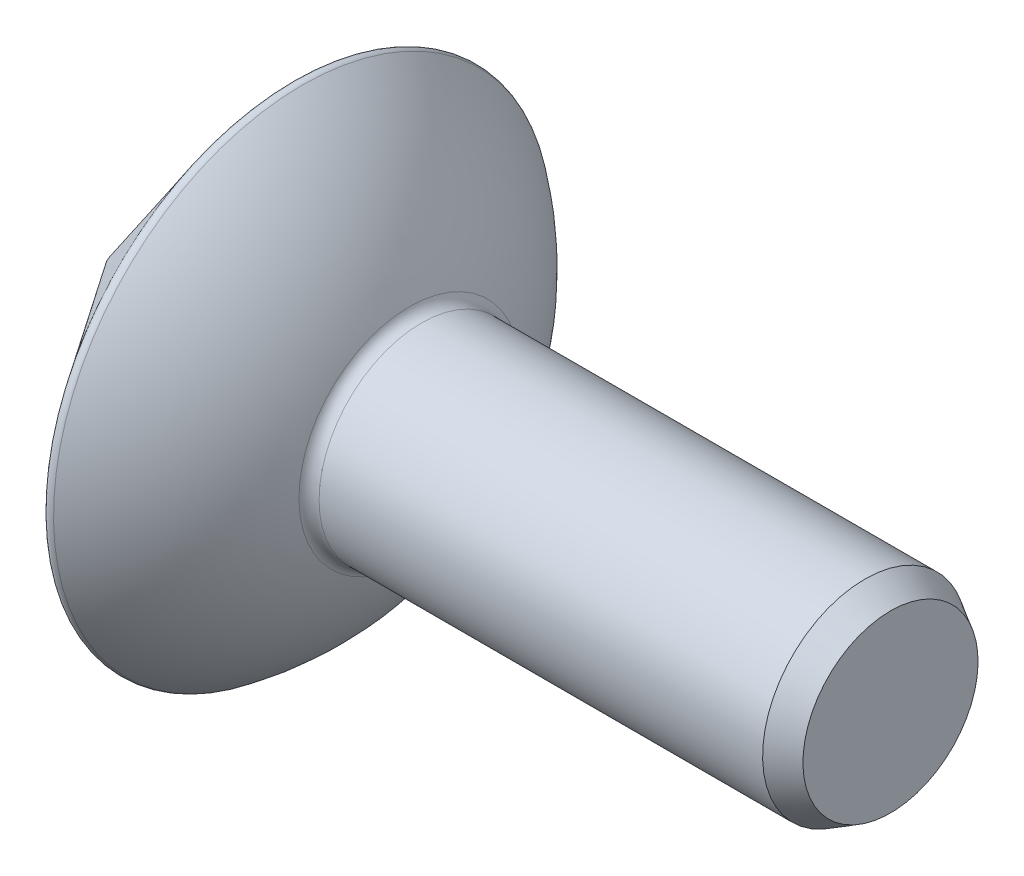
ISO-10303-21;
HEADER;
FILE_DESCRIPTION(('STEP AP214'),'2;1');
FILE_NAME('part.step','',(''),(''),'','','');
FILE_SCHEMA(('AUTOMOTIVE_DESIGN { 1 0 10303 214 1 1 1 1 }'));
ENDSEC;
DATA;
#1=APPLICATION_CONTEXT('core data for automotive mechanical design processes');
#2=APPLICATION_PROTOCOL_DEFINITION('international standard','automotive_design',2000,#1);
#3=PRODUCT_CONTEXT('',#1,'mechanical');
#4=PRODUCT('Part','Part','',(#3));
#5=PRODUCT_RELATED_PRODUCT_CATEGORY('part','',(#4));
#6=PRODUCT_DEFINITION_FORMATION('','',#4);
#7=PRODUCT_DEFINITION_CONTEXT('part definition',#1,'design');
#8=PRODUCT_DEFINITION('design','',#6,#7);
#9=PRODUCT_DEFINITION_SHAPE('','',#8);
#10=(LENGTH_UNIT() NAMED_UNIT(*) SI_UNIT(.MILLI.,.METRE.));
#11=(NAMED_UNIT(*) PLANE_ANGLE_UNIT() SI_UNIT($,.RADIAN.));
#12=(NAMED_UNIT(*) SI_UNIT($,.STERADIAN.) SOLID_ANGLE_UNIT());
#13=UNCERTAINTY_MEASURE_WITH_UNIT(LENGTH_MEASURE(1.E-05),#10,'distance_accuracy_value','');
#14=(GEOMETRIC_REPRESENTATION_CONTEXT(3) GLOBAL_UNCERTAINTY_ASSIGNED_CONTEXT((#13)) GLOBAL_UNIT_ASSIGNED_CONTEXT((#10,
#11,#12)) REPRESENTATION_CONTEXT('',''));
#15=CARTESIAN_POINT('',(0.,0.,0.));
#16=DIRECTION('',(0.,0.,1.));
#17=DIRECTION('',(1.,0.,0.));
#18=AXIS2_PLACEMENT_3D('',#15,#16,#17);
#19=CARTESIAN_POINT('',(30.,4.,0.));
#20=DIRECTION('',(1.,0.,0.));
#21=DIRECTION('',(0.,1.,0.));
#22=AXIS2_PLACEMENT_3D('',#19,#20,#21);
#23=PLANE('',#22);
#24=CARTESIAN_POINT('',(30.,0.,0.));
#25=DIRECTION('',(1.,0.,0.));
#26=DIRECTION('',(0.,1.,0.));
#27=AXIS2_PLACEMENT_3D('',#24,#25,#26);
#28=CIRCLE('',#27,3.42264973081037);
#29=CARTESIAN_POINT('',(30.,3.42264973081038,0.));
#30=VERTEX_POINT('',#29);
#31=EDGE_CURVE('E47',#30,#30,#28,.T.);
#32=ORIENTED_EDGE('',*,*,#31,.T.);
#33=EDGE_LOOP('',(#32));
#34=FACE_BOUND('',#33,.T.);
#35=ADVANCED_FACE('F32',(#34),#23,.T.);
#36=CARTESIAN_POINT('',(0.,0.,0.));
#37=DIRECTION('',(1.,0.,0.));
#38=DIRECTION('',(0.,1.,0.));
#39=AXIS2_PLACEMENT_3D('',#36,#37,#38);
#40=CYLINDRICAL_SURFACE('',#39,4.);
#41=CARTESIAN_POINT('',(11.6619037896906,0.,0.));
#42=DIRECTION('',(-1.,0.,0.));
#43=DIRECTION('',(0.,-1.,0.));
#44=AXIS2_PLACEMENT_3D('',#41,#42,#43);
#45=CIRCLE('',#44,4.);
#46=CARTESIAN_POINT('',(11.6619037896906,-3.99999999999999,0.));
#47=VERTEX_POINT('',#46);
#48=EDGE_CURVE('E39',#47,#47,#45,.F.);
#49=ORIENTED_EDGE('',*,*,#48,.T.);
#50=EDGE_LOOP('',(#49));
#51=FACE_BOUND('',#50,.T.);
#52=CARTESIAN_POINT('',(29.,0.,0.));
#53=DIRECTION('',(1.,0.,0.));
#54=DIRECTION('',(0.,1.,0.));
#55=AXIS2_PLACEMENT_3D('',#52,#53,#54);
#56=CIRCLE('',#55,4.);
#57=CARTESIAN_POINT('',(29.,4.,0.));
#58=VERTEX_POINT('',#57);
#59=EDGE_CURVE('E43',#58,#58,#56,.F.);
#60=ORIENTED_EDGE('',*,*,#59,.T.);
#61=EDGE_LOOP('',(#60));
#62=FACE_BOUND('',#61,.T.);
#63=ADVANCED_FACE('F79',(#51,#62),#40,.T.);
#64=CARTESIAN_POINT('',(0.,0.,0.));
#65=DIRECTION('',(1.,0.,0.));
#66=DIRECTION('',(0.,1.,0.));
#67=AXIS2_PLACEMENT_3D('',#64,#65,#66);
#68=SPHERICAL_SURFACE('',#67,12.);
#69=CARTESIAN_POINT('',(11.195427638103,0.,0.));
#70=DIRECTION('',(-1.,0.,0.));
#71=DIRECTION('',(0.,-1.,0.));
#72=AXIS2_PLACEMENT_3D('',#69,#70,#71);
#73=CIRCLE('',#72,4.32);
#74=CARTESIAN_POINT('',(11.195427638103,4.32,0.));
#75=VERTEX_POINT('',#74);
#76=EDGE_CURVE('E10',#75,#75,#73,.T.);
#77=CARTESIAN_POINT('',(7.01623852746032,0.,0.));
#78=DIRECTION('',(-1.,0.,0.));
#79=DIRECTION('',(0.,-1.,0.));
#80=AXIS2_PLACEMENT_3D('',#77,#78,#79);
#81=CIRCLE('',#80,9.73511155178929);
#82=CARTESIAN_POINT('',(7.01623852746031,9.73511155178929,0.));
#83=VERTEX_POINT('',#82);
#84=EDGE_CURVE('E55',#83,#83,#81,.F.);
#85=CARTESIAN_POINT('',(11.195427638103,4.32,0.));
#86=CARTESIAN_POINT('',(11.1694161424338,4.38740989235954,0.));
#87=CARTESIAN_POINT('',(11.1427956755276,4.45458479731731,0.));
#88=CARTESIAN_POINT('',(11.0883457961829,4.58844284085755,0.));
#89=CARTESIAN_POINT('',(11.0605163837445,4.65512597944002,0.));
#90=CARTESIAN_POINT('',(11.0036576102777,4.78797869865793,0.));
#91=CARTESIAN_POINT('',(10.9746282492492,4.85414827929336,0.));
#92=CARTESIAN_POINT('',(10.9153790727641,4.98595230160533,0.));
#93=CARTESIAN_POINT('',(10.8851592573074,5.05158674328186,0.));
#94=CARTESIAN_POINT('',(10.8235390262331,5.18229906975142,0.));
#95=CARTESIAN_POINT('',(10.7921386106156,5.24737695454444,0.));
#96=CARTESIAN_POINT('',(10.7281674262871,5.37695493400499,0.));
#97=CARTESIAN_POINT('',(10.6955966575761,5.44145502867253,0.));
#98=CARTESIAN_POINT('',(10.6292953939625,5.56985638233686,0.));
#99=CARTESIAN_POINT('',(10.5955648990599,5.63375764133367,0.));
#100=CARTESIAN_POINT('',(10.5269551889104,5.76094047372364,0.));
#101=CARTESIAN_POINT('',(10.4920759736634,5.82422204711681,0.));
#102=CARTESIAN_POINT('',(10.4211802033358,5.95014486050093,0.));
#103=CARTESIAN_POINT('',(10.3851636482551,6.01278610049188,0.));
#104=CARTESIAN_POINT('',(10.312004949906,6.13740780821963,0.));
#105=CARTESIAN_POINT('',(10.2748628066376,6.19938827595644,0.));
#106=CARTESIAN_POINT('',(10.1994650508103,6.32266821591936,0.));
#107=CARTESIAN_POINT('',(10.1612094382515,6.38396768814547,0.));
#108=CARTESIAN_POINT('',(10.0835972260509,6.50586563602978,0.));
#109=CARTESIAN_POINT('',(10.0442406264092,6.56646411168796,0.));
#110=CARTESIAN_POINT('',(9.96443928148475,6.68694029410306,0.));
#111=CARTESIAN_POINT('',(9.923994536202,6.74681800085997,0.));
#112=CARTESIAN_POINT('',(9.84203009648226,6.86583310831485,0.));
#113=CARTESIAN_POINT('',(9.80051040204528,6.92497050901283,0.));
#114=CARTESIAN_POINT('',(9.71640961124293,7.04248570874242,0.));
#115=CARTESIAN_POINT('',(9.67382851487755,7.10086350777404,0.));
#116=CARTESIAN_POINT('',(9.5876188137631,7.21684045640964,0.));
#117=CARTESIAN_POINT('',(9.54399020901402,7.27443960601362,0.));
#118=CARTESIAN_POINT('',(9.45569972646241,7.38884046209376,0.));
#119=CARTESIAN_POINT('',(9.41103784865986,7.44564216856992,0.));
#120=CARTESIAN_POINT('',(9.32069539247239,7.55842960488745,0.));
#121=CARTESIAN_POINT('',(9.27501481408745,7.61441533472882,0.));
#122=CARTESIAN_POINT('',(9.18264986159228,7.72555255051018,0.));
#123=CARTESIAN_POINT('',(9.13596548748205,7.78070403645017,0.));
#124=CARTESIAN_POINT('',(9.04160817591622,7.8901547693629,0.));
#125=CARTESIAN_POINT('',(8.99393523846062,7.94445401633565,0.));
#126=CARTESIAN_POINT('',(8.89761635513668,8.05218255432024,0.));
#127=CARTESIAN_POINT('',(8.84897040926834,8.10561184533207,0.));
#128=CARTESIAN_POINT('',(8.75072138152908,8.21158303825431,0.));
#129=CARTESIAN_POINT('',(8.70111829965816,8.26412494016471,0.));
#130=CARTESIAN_POINT('',(8.60097118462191,8.36830421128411,0.));
#131=CARTESIAN_POINT('',(8.55042715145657,8.41994158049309,0.));
#132=CARTESIAN_POINT('',(8.44841462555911,8.52229493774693,0.));
#133=CARTESIAN_POINT('',(8.39694613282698,8.57301092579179,0.));
#134=CARTESIAN_POINT('',(8.2931014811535,8.67350497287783,0.));
#135=CARTESIAN_POINT('',(8.24072532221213,8.72328303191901,0.));
#136=CARTESIAN_POINT('',(8.13508242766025,8.82188497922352,0.));
#137=CARTESIAN_POINT('',(8.08181569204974,8.87070886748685,0.));
#138=CARTESIAN_POINT('',(7.97440902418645,8.96738654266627,0.));
#139=CARTESIAN_POINT('',(7.92026909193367,9.01524032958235,0.));
#140=CARTESIAN_POINT('',(7.81113369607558,9.10996218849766,0.));
#141=CARTESIAN_POINT('',(7.75613823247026,9.15683026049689,0.));
#142=CARTESIAN_POINT('',(7.64530971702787,9.24956539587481,0.));
#143=CARTESIAN_POINT('',(7.5894766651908,9.29543245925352,0.));
#144=CARTESIAN_POINT('',(7.47699119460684,9.38615061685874,0.));
#145=CARTESIAN_POINT('',(7.42033877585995,9.43100171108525,0.));
#146=CARTESIAN_POINT('',(7.30623304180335,9.51967327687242,0.));
#147=CARTESIAN_POINT('',(7.24877972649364,9.56349374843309,0.));
#148=CARTESIAN_POINT('',(7.13309099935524,9.65008984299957,0.));
#149=CARTESIAN_POINT('',(7.07485558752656,9.69286546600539,0.));
#150=CARTESIAN_POINT('',(7.01623852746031,9.73511155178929,0.));
#151=B_SPLINE_CURVE_WITH_KNOTS('',3,(#85,#86,#87,#88,#89,#90,#91,#92,#93,#94,#95,#96,#97,#98,
#99,#100,#101,#102,#103,#104,#105,#106,#107,#108,#109,#110,#111,#112,#113,#114,#115,#116,#117,
#118,#119,#120,#121,#122,#123,#124,#125,#126,#127,#128,#129,#130,#131,#132,#133,#134,#135,#136,
#137,#138,#139,#140,#141,#142,#143,#144,#145,#146,#147,#148,#149,#150),.UNSPECIFIED.,.F.,.F.,(4,
2,2,2,2,2,2,2,2,2,2,2,2,2,2,2,2,2,2,2,2,2,2,2,2,2,2,2,2,2,2,2,4),(0.,0.216760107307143,
0.433520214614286,0.650280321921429,0.867040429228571,1.08380053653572,1.30056064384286,
1.51732075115,1.73408085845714,1.95084096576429,2.16760107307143,2.38436118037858,
2.60112128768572,2.81788139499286,3.0346415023,3.25140160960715,3.46816171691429,
3.68492182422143,3.90168193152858,4.11844203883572,4.33520214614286,4.55196225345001,
4.76872236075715,4.98548246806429,5.20224257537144,5.41900268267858,5.63576278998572,
5.85252289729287,6.06928300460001,6.28604311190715,6.50280321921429,6.71956332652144,
6.93632343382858),.UNSPECIFIED.);
#152=EDGE_CURVE('BSEAM75',#75,#83,#151,.T.);
#153=ORIENTED_EDGE('',*,*,#76,.T.);
#154=ORIENTED_EDGE('',*,*,#84,.T.);
#155=ORIENTED_EDGE('',*,*,#152,.T.);
#156=ORIENTED_EDGE('',*,*,#152,.F.);
#157=EDGE_LOOP('',(#153,#155,#154,#156));
#158=FACE_BOUND('',#157,.T.);
#159=ADVANCED_FACE('F75',(#158),#68,.T.);
#160=CARTESIAN_POINT('',(6.81619089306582,0.,0.));
#161=DIRECTION('',(1.,0.,0.));
#162=DIRECTION('',(0.,1.,0.));
#163=AXIS2_PLACEMENT_3D('',#160,#161,#162);
#164=CONICAL_SURFACE('',#163,9.87621089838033,0.92502450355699);
#165=CARTESIAN_POINT('',(6.67040801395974,0.,0.));
#166=DIRECTION('',(-1.,0.,0.));
#167=DIRECTION('',(0.,-1.,0.));
#168=AXIS2_PLACEMENT_3D('',#165,#166,#167);
#169=CIRCLE('',#168,9.6827504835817);
#170=CARTESIAN_POINT('',(6.67040801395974,9.6827504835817,0.));
#171=VERTEX_POINT('',#170);
#172=EDGE_CURVE('E52',#171,#171,#169,.T.);
#173=CARTESIAN_POINT('',(-0.399317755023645,0.,0.));
#174=DIRECTION('',(1.,0.,0.));
#175=DIRECTION('',(0.,1.,0.));
#176=AXIS2_PLACEMENT_3D('',#173,#174,#175);
#177=CIRCLE('',#176,0.300907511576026);
#178=CARTESIAN_POINT('',(-0.399317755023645,0.300907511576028,0.));
#179=VERTEX_POINT('',#178);
#180=EDGE_CURVE('E58',#179,#179,#177,.T.);
#181=CARTESIAN_POINT('',(6.67040801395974,9.6827504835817,0.));
#182=CARTESIAN_POINT('',(6.59676503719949,9.58502295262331,0.));
#183=CARTESIAN_POINT('',(6.52312206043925,9.48729542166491,0.));
#184=CARTESIAN_POINT('',(6.37583610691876,9.29184035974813,0.));
#185=CARTESIAN_POINT('',(6.30219313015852,9.19411282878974,0.));
#186=CARTESIAN_POINT('',(6.15490717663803,8.99865776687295,0.));
#187=CARTESIAN_POINT('',(6.08126419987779,8.90093023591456,0.));
#188=CARTESIAN_POINT('',(5.9339782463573,8.70547517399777,0.));
#189=CARTESIAN_POINT('',(5.86033526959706,8.60774764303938,0.));
#190=CARTESIAN_POINT('',(5.71304931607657,8.4122925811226,0.));
#191=CARTESIAN_POINT('',(5.63940633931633,8.3145650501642,0.));
#192=CARTESIAN_POINT('',(5.49212038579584,8.11910998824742,0.));
#193=CARTESIAN_POINT('',(5.41847740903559,8.02138245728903,0.));
#194=CARTESIAN_POINT('',(5.27119145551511,7.82592739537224,0.));
#195=CARTESIAN_POINT('',(5.19754847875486,7.72819986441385,0.));
#196=CARTESIAN_POINT('',(5.05026252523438,7.53274480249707,0.));
#197=CARTESIAN_POINT('',(4.97661954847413,7.43501727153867,0.));
#198=CARTESIAN_POINT('',(4.82933359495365,7.23956220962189,0.));
#199=CARTESIAN_POINT('',(4.7556906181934,7.1418346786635,0.));
#200=CARTESIAN_POINT('',(4.60840466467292,6.94637961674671,0.));
#201=CARTESIAN_POINT('',(4.53476168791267,6.84865208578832,0.));
#202=CARTESIAN_POINT('',(4.38747573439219,6.65319702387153,0.));
#203=CARTESIAN_POINT('',(4.31383275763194,6.55546949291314,0.));
#204=CARTESIAN_POINT('',(4.16654680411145,6.36001443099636,0.));
#205=CARTESIAN_POINT('',(4.09290382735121,6.26228690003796,0.));
#206=CARTESIAN_POINT('',(3.94561787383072,6.06683183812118,0.));
#207=CARTESIAN_POINT('',(3.87197489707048,5.96910430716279,0.));
#208=CARTESIAN_POINT('',(3.72468894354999,5.773649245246,0.));
#209=CARTESIAN_POINT('',(3.65104596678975,5.67592171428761,0.));
#210=CARTESIAN_POINT('',(3.50376001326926,5.48046665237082,0.));
#211=CARTESIAN_POINT('',(3.43011703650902,5.38273912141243,0.));
#212=CARTESIAN_POINT('',(3.28283108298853,5.18728405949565,0.));
#213=CARTESIAN_POINT('',(3.20918810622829,5.08955652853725,0.));
#214=CARTESIAN_POINT('',(3.0619021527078,4.89410146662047,0.));
#215=CARTESIAN_POINT('',(2.98825917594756,4.79637393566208,0.));
#216=CARTESIAN_POINT('',(2.84097322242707,4.60091887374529,0.));
#217=CARTESIAN_POINT('',(2.76733024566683,4.5031913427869,0.));
#218=CARTESIAN_POINT('',(2.62004429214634,4.30773628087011,0.));
#219=CARTESIAN_POINT('',(2.5464013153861,4.21000874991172,0.));
#220=CARTESIAN_POINT('',(2.39911536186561,4.01455368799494,0.));
#221=CARTESIAN_POINT('',(2.32547238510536,3.91682615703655,0.));
#222=CARTESIAN_POINT('',(2.17818643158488,3.72137109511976,0.));
#223=CARTESIAN_POINT('',(2.10454345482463,3.62364356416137,0.));
#224=CARTESIAN_POINT('',(1.95725750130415,3.42818850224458,0.));
#225=CARTESIAN_POINT('',(1.88361452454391,3.33046097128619,0.));
#226=CARTESIAN_POINT('',(1.73632857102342,3.13500590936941,0.));
#227=CARTESIAN_POINT('',(1.66268559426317,3.03727837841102,0.));
#228=CARTESIAN_POINT('',(1.51539964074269,2.84182331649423,0.));
#229=CARTESIAN_POINT('',(1.44175666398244,2.74409578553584,0.));
#230=CARTESIAN_POINT('',(1.29447071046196,2.54864072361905,0.));
#231=CARTESIAN_POINT('',(1.22082773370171,2.45091319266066,0.));
#232=CARTESIAN_POINT('',(1.07354178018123,2.25545813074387,0.));
#233=CARTESIAN_POINT('',(0.999898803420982,2.15773059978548,0.));
#234=CARTESIAN_POINT('',(0.852612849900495,1.9622755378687,0.));
#235=CARTESIAN_POINT('',(0.778969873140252,1.86454800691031,0.));
#236=CARTESIAN_POINT('',(0.631683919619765,1.66909294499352,0.));
#237=CARTESIAN_POINT('',(0.558040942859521,1.57136541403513,0.));
#238=CARTESIAN_POINT('',(0.410754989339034,1.37591035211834,0.));
#239=CARTESIAN_POINT('',(0.337112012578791,1.27818282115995,0.));
#240=CARTESIAN_POINT('',(0.189826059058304,1.08272775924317,0.));
#241=CARTESIAN_POINT('',(0.11618308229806,0.985000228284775,0.));
#242=CARTESIAN_POINT('',(-0.0311028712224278,0.789545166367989,0.));
#243=CARTESIAN_POINT('',(-0.104745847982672,0.691817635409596,0.));
#244=CARTESIAN_POINT('',(-0.252031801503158,0.496362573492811,0.));
#245=CARTESIAN_POINT('',(-0.325674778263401,0.398635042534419,0.));
#246=CARTESIAN_POINT('',(-0.399317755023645,0.300907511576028,0.));
#247=B_SPLINE_CURVE_WITH_KNOTS('',3,(#181,#182,#183,#184,#185,#186,#187,#188,#189,#190,#191,
#192,#193,#194,#195,#196,#197,#198,#199,#200,#201,#202,#203,#204,#205,#206,#207,#208,#209,#210,
#211,#212,#213,#214,#215,#216,#217,#218,#219,#220,#221,#222,#223,#224,#225,#226,#227,#228,#229,
#230,#231,#232,#233,#234,#235,#236,#237,#238,#239,#240,#241,#242,#243,#244,#245,#246),
.UNSPECIFIED.,.F.,.F.,(4,2,2,2,2,2,2,2,2,2,2,2,2,2,2,2,2,2,2,2,2,2,2,2,2,2,2,2,2,2,2,2,4),(0.,
0.367104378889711,0.734208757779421,1.10131313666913,1.46841751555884,1.83552189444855,
2.20262627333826,2.56973065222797,2.93683503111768,3.30393941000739,3.6710437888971,
4.03814816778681,4.40525254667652,4.77235692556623,5.13946130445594,5.50656568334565,
5.87367006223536,6.24077444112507,6.60787882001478,6.97498319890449,7.3420875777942,
7.70919195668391,8.07629633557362,8.44340071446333,8.81050509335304,9.17760947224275,
9.54471385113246,9.91181823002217,10.2789226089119,10.6460269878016,11.0131313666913,
11.380235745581,11.7473401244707),.UNSPECIFIED.);
#248=EDGE_CURVE('BSEAM62',#171,#179,#247,.T.);
#249=ORIENTED_EDGE('',*,*,#172,.T.);
#250=ORIENTED_EDGE('',*,*,#180,.T.);
#251=ORIENTED_EDGE('',*,*,#248,.T.);
#252=ORIENTED_EDGE('',*,*,#248,.F.);
#253=EDGE_LOOP('',(#249,#251,#250,#252));
#254=FACE_BOUND('',#253,.T.);
#255=ADVANCED_FACE('F62',(#254),#164,.T.);
#256=CARTESIAN_POINT('',(0.,0.,0.));
#257=DIRECTION('',(1.,0.,0.));
#258=DIRECTION('',(0.,1.,0.));
#259=AXIS2_PLACEMENT_3D('',#256,#257,#258);
#260=SPHERICAL_SURFACE('',#259,0.5);
#261=ORIENTED_EDGE('',*,*,#180,.F.);
#262=EDGE_LOOP('',(#261));
#263=FACE_BOUND('',#262,.T.);
#264=ADVANCED_FACE('F64',(#263),#260,.T.);
#265=CARTESIAN_POINT('',(6.87006689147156,0.,0.));
#266=DIRECTION('',(-1.,0.,0.));
#267=DIRECTION('',(0.,-1.,0.));
#268=AXIS2_PLACEMENT_3D('',#265,#266,#267);
#269=TOROIDAL_SURFACE('',#268,9.53229672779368,0.25);
#270=ORIENTED_EDGE('',*,*,#172,.F.);
#271=EDGE_LOOP('',(#270));
#272=FACE_BOUND('',#271,.T.);
#273=ORIENTED_EDGE('',*,*,#84,.F.);
#274=EDGE_LOOP('',(#273));
#275=FACE_BOUND('',#274,.T.);
#276=ADVANCED_FACE('F66',(#272,#275),#269,.T.);
#277=CARTESIAN_POINT('',(30.,0.,0.));
#278=DIRECTION('',(-1.,0.,0.));
#279=DIRECTION('',(0.,-1.,0.));
#280=AXIS2_PLACEMENT_3D('',#277,#278,#279);
#281=CONICAL_SURFACE('',#280,3.42264973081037,0.523598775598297);
#282=ORIENTED_EDGE('',*,*,#59,.F.);
#283=EDGE_LOOP('',(#282));
#284=FACE_BOUND('',#283,.T.);
#285=ORIENTED_EDGE('',*,*,#31,.F.);
#286=EDGE_LOOP('',(#285));
#287=FACE_BOUND('',#286,.T.);
#288=ADVANCED_FACE('F72',(#284,#287),#281,.T.);
#289=CARTESIAN_POINT('',(11.6619037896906,0.,0.));
#290=DIRECTION('',(-1.,0.,0.));
#291=DIRECTION('',(0.,-1.,0.));
#292=AXIS2_PLACEMENT_3D('',#289,#290,#291);
#293=TOROIDAL_SURFACE('',#292,4.5,0.5);
#294=ORIENTED_EDGE('',*,*,#76,.F.);
#295=EDGE_LOOP('',(#294));
#296=FACE_BOUND('',#295,.T.);
#297=ORIENTED_EDGE('',*,*,#48,.F.);
#298=EDGE_LOOP('',(#297));
#299=FACE_BOUND('',#298,.T.);
#300=ADVANCED_FACE('F34',(#296,#299),#293,.F.);
#301=CLOSED_SHELL('',(#35,#63,#159,#255,#264,#276,#288,#300));
#302=MANIFOLD_SOLID_BREP('B2',#301);
#303=ADVANCED_BREP_SHAPE_REPRESENTATION('',(#18,#302),#14);
#304=SHAPE_DEFINITION_REPRESENTATION(#9,#303);
ENDSEC;
END-ISO-10303-21;
